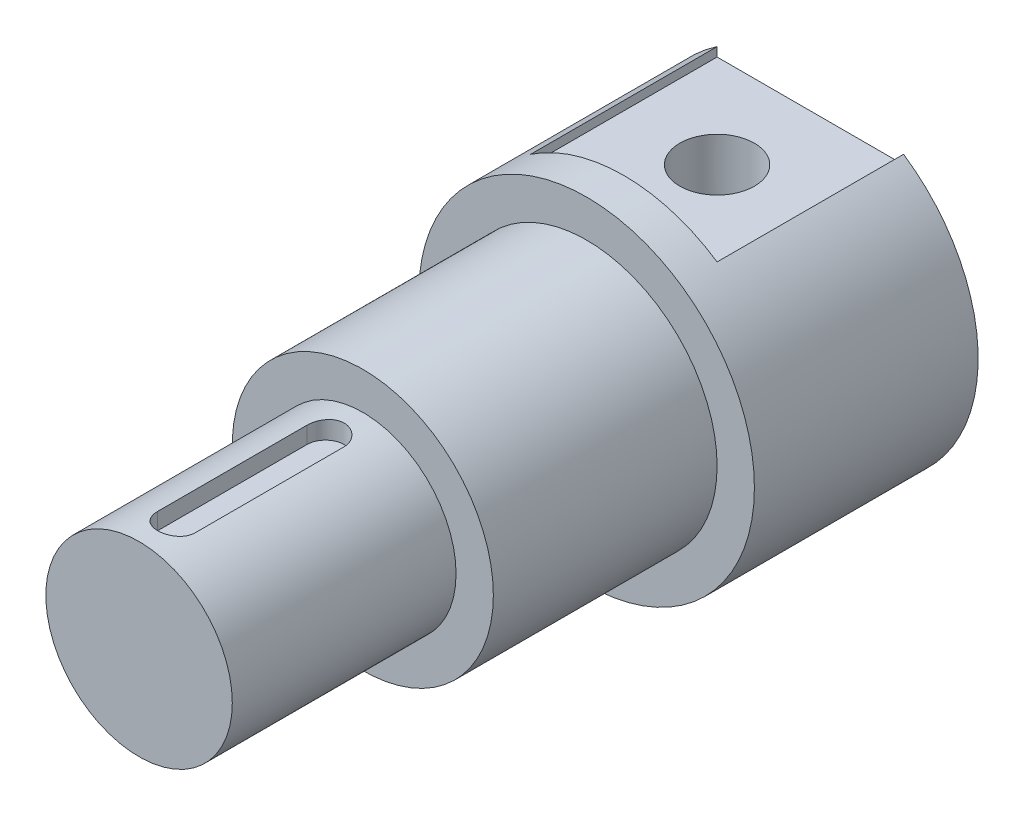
from build123d import *

# Parameters (mm, degrees)
CROQUIS1_R              = 18
SALIENTE_EXTRUIR1_DEPTH = 24
CROQUIS2_R              = 14
SALIENTE_EXTRUIR2_DEPTH = 24
CROQUIS3_R              = 10
SALIENTE_EXTRUIR3_DEPTH = 24
CORTAR_EXTRUIR1_DEPTH   = 2
CORTAR_EXTRUIR2_START   = 2
CORTAR_EXTRUIR2_DEPTH   = 2
CROQUIS6_W              = 20
CROQUIS6_H              = 20
CORTAR_EXTRUIR3_DEPTH   = 4
CROQUIS7_W              = 20
CROQUIS7_H              = 20
CORTAR_EXTRUIR4_DEPTH   = 4
CROQUIS8_R              = 4
CORTAR_EXTRUIR5_DEPTH   = 81.820789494


with BuildPart() as part:
    # Croquis1 → Saliente-Extruir1 (new body)
    with BuildSketch(Plane.XY):
        Circle(CROQUIS1_R)
    extrude(amount=SALIENTE_EXTRUIR1_DEPTH)

    # Croquis2 → Saliente-Extruir2 (add)
    with BuildSketch(Plane.XY.offset(24)):
        Circle(CROQUIS2_R)
    extrude(amount=SALIENTE_EXTRUIR2_DEPTH)

    # Croquis3 → Saliente-Extruir3 (add)
    with BuildSketch(Plane.XY.offset(48)):
        Circle(CROQUIS3_R)
    extrude(amount=SALIENTE_EXTRUIR3_DEPTH)

    # Croquis4 → Cortar-Extruir1 (cut)
    with BuildSketch(Plane(origin=(0, 10, 0), x_dir=(1, 0, 0), z_dir=(0, 1, 0))):
        with BuildLine():
            Line((2, -52), (2, -68))
            ThreePointArc((2, -68), (0, -70), (-2, -68))
            Line((-2, -68), (-2, -52))
            ThreePointArc((-2, -52), (0, -50), (2, -52))
        make_face()
    extrude(amount=-CORTAR_EXTRUIR1_DEPTH, mode=Mode.SUBTRACT)

    # Croquis5 → Cortar-Extruir2 (cut)
    with BuildSketch(Plane(origin=(0, -10, 0), x_dir=(1, 0, 0), z_dir=(0, 1, 0)).offset(CORTAR_EXTRUIR2_START)):
        with BuildLine():
            Line((-2, -68), (-2, -52))
            ThreePointArc((-2, -52), (0, -50), (2, -52))
            Line((2, -52), (2, -68))
            ThreePointArc((2, -68), (0, -70), (-2, -68))
        make_face()
    extrude(amount=-CORTAR_EXTRUIR2_DEPTH, mode=Mode.SUBTRACT)

    # Croquis6 → Cortar-Extruir3 (cut)
    with BuildSketch(Plane(origin=(0, 18, 0), x_dir=(1, 0, 0), z_dir=(0, 1, 0))):
        with Locations((0, -10)):
            Rectangle(CROQUIS6_W, CROQUIS6_H)
    extrude(amount=-CORTAR_EXTRUIR3_DEPTH, mode=Mode.SUBTRACT)

    # Croquis7 → Cortar-Extruir4 (cut)
    with BuildSketch(Plane(origin=(0, -18, 0), x_dir=(1, 0, 0), z_dir=(0, 1, 0))):
        with Locations((0, -10)):
            Rectangle(CROQUIS7_W, CROQUIS7_H)
    extrude(amount=CORTAR_EXTRUIR4_DEPTH, mode=Mode.SUBTRACT)

    # Croquis8 → Cortar-Extruir5 (cut, through all)
    with BuildSketch(Plane.XZ.offset(14)):
        with Locations(Location((0, 10, 0), (0, 0, 270))):
            Circle(CROQUIS8_R)
    extrude(amount=-CORTAR_EXTRUIR5_DEPTH, mode=Mode.SUBTRACT)


solid = part.part
